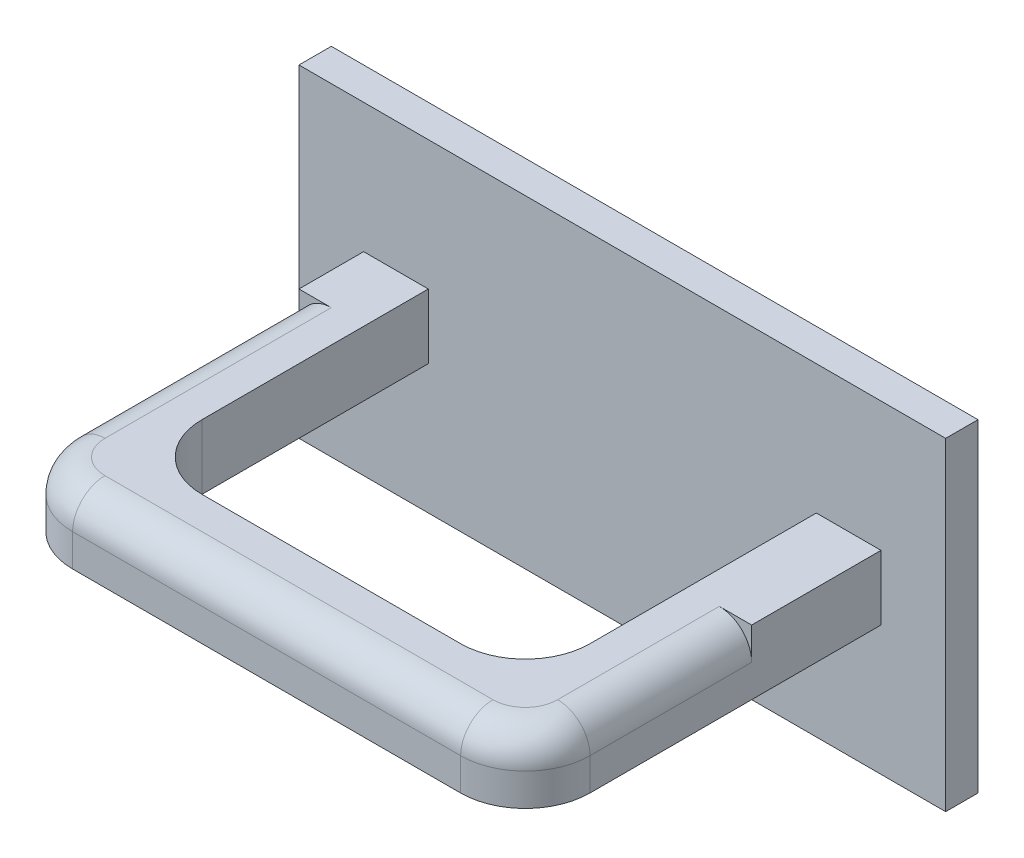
ISO-10303-21;
HEADER;
FILE_DESCRIPTION(('STEP AP214'),'2;1');
FILE_NAME('part.step','',(''),(''),'','','');
FILE_SCHEMA(('AUTOMOTIVE_DESIGN { 1 0 10303 214 1 1 1 1 }'));
ENDSEC;
DATA;
#1=APPLICATION_CONTEXT('core data for automotive mechanical design processes');
#2=APPLICATION_PROTOCOL_DEFINITION('international standard','automotive_design',2000,#1);
#3=PRODUCT_CONTEXT('',#1,'mechanical');
#4=PRODUCT('Part','Part','',(#3));
#5=PRODUCT_RELATED_PRODUCT_CATEGORY('part','',(#4));
#6=PRODUCT_DEFINITION_FORMATION('','',#4);
#7=PRODUCT_DEFINITION_CONTEXT('part definition',#1,'design');
#8=PRODUCT_DEFINITION('design','',#6,#7);
#9=PRODUCT_DEFINITION_SHAPE('','',#8);
#10=(LENGTH_UNIT() NAMED_UNIT(*) SI_UNIT(.MILLI.,.METRE.));
#11=(NAMED_UNIT(*) PLANE_ANGLE_UNIT() SI_UNIT($,.RADIAN.));
#12=(NAMED_UNIT(*) SI_UNIT($,.STERADIAN.) SOLID_ANGLE_UNIT());
#13=UNCERTAINTY_MEASURE_WITH_UNIT(LENGTH_MEASURE(1.E-05),#10,'distance_accuracy_value','');
#14=(GEOMETRIC_REPRESENTATION_CONTEXT(3) GLOBAL_UNCERTAINTY_ASSIGNED_CONTEXT((#13)) GLOBAL_UNIT_ASSIGNED_CONTEXT((#10,
#11,#12)) REPRESENTATION_CONTEXT('',''));
#15=CARTESIAN_POINT('',(0.,0.,0.));
#16=DIRECTION('',(0.,0.,1.));
#17=DIRECTION('',(1.,0.,0.));
#18=AXIS2_PLACEMENT_3D('',#15,#16,#17);
#19=CARTESIAN_POINT('',(-50.,25.,5.));
#20=DIRECTION('',(1.,0.,0.));
#21=DIRECTION('',(0.,1.,0.));
#22=AXIS2_PLACEMENT_3D('',#19,#20,#21);
#23=PLANE('',#22);
#24=DIRECTION('',(0.,-1.,0.));
#25=VECTOR('',#24,1.);
#26=CARTESIAN_POINT('',(-50.,25.,0.));
#27=LINE('',#26,#25);
#28=CARTESIAN_POINT('',(-50.,25.,0.));
#29=VERTEX_POINT('',#28);
#30=CARTESIAN_POINT('',(-50.,-25.,0.));
#31=VERTEX_POINT('',#30);
#32=EDGE_CURVE('E216',#29,#31,#27,.T.);
#33=ORIENTED_EDGE('',*,*,#32,.T.);
#34=DIRECTION('',(0.,0.,-1.));
#35=VECTOR('',#34,1.);
#36=CARTESIAN_POINT('',(-50.,-25.,5.));
#37=LINE('',#36,#35);
#38=CARTESIAN_POINT('',(-50.,-25.,5.));
#39=VERTEX_POINT('',#38);
#40=EDGE_CURVE('E264',#39,#31,#37,.T.);
#41=ORIENTED_EDGE('',*,*,#40,.F.);
#42=DIRECTION('',(0.,-1.,0.));
#43=VECTOR('',#42,1.);
#44=CARTESIAN_POINT('',(-50.,25.,5.));
#45=LINE('',#44,#43);
#46=CARTESIAN_POINT('',(-50.,25.,5.));
#47=VERTEX_POINT('',#46);
#48=EDGE_CURVE('E229',#47,#39,#45,.T.);
#49=ORIENTED_EDGE('',*,*,#48,.F.);
#50=DIRECTION('',(0.,0.,-1.));
#51=VECTOR('',#50,1.);
#52=CARTESIAN_POINT('',(-50.,25.,5.));
#53=LINE('',#52,#51);
#54=EDGE_CURVE('E244',#47,#29,#53,.T.);
#55=ORIENTED_EDGE('',*,*,#54,.T.);
#56=EDGE_LOOP('',(#33,#41,#49,#55));
#57=FACE_BOUND('',#56,.T.);
#58=ADVANCED_FACE('F42',(#57),#23,.F.);
#59=CARTESIAN_POINT('',(-50.,-25.,5.));
#60=DIRECTION('',(0.,1.,0.));
#61=DIRECTION('',(0.,0.,1.));
#62=AXIS2_PLACEMENT_3D('',#59,#60,#61);
#63=PLANE('',#62);
#64=DIRECTION('',(1.,0.,0.));
#65=VECTOR('',#64,1.);
#66=CARTESIAN_POINT('',(-50.,-25.,0.));
#67=LINE('',#66,#65);
#68=CARTESIAN_POINT('',(50.,-25.,0.));
#69=VERTEX_POINT('',#68);
#70=EDGE_CURVE('E222',#31,#69,#67,.T.);
#71=ORIENTED_EDGE('',*,*,#70,.T.);
#72=DIRECTION('',(0.,0.,-1.));
#73=VECTOR('',#72,1.);
#74=CARTESIAN_POINT('',(50.,-25.,5.));
#75=LINE('',#74,#73);
#76=CARTESIAN_POINT('',(50.,-25.,5.));
#77=VERTEX_POINT('',#76);
#78=EDGE_CURVE('E261',#77,#69,#75,.T.);
#79=ORIENTED_EDGE('',*,*,#78,.F.);
#80=DIRECTION('',(1.,0.,0.));
#81=VECTOR('',#80,1.);
#82=CARTESIAN_POINT('',(-50.,-25.,5.));
#83=LINE('',#82,#81);
#84=EDGE_CURVE('E233',#39,#77,#83,.T.);
#85=ORIENTED_EDGE('',*,*,#84,.F.);
#86=ORIENTED_EDGE('',*,*,#40,.T.);
#87=EDGE_LOOP('',(#71,#79,#85,#86));
#88=FACE_BOUND('',#87,.T.);
#89=ADVANCED_FACE('F474',(#88),#63,.F.);
#90=CARTESIAN_POINT('',(50.,25.,5.));
#91=DIRECTION('',(1.,0.,0.));
#92=DIRECTION('',(0.,1.,0.));
#93=AXIS2_PLACEMENT_3D('',#90,#91,#92);
#94=PLANE('',#93);
#95=DIRECTION('',(0.,-1.,0.));
#96=VECTOR('',#95,1.);
#97=CARTESIAN_POINT('',(50.,25.,0.));
#98=LINE('',#97,#96);
#99=CARTESIAN_POINT('',(50.,25.,0.));
#100=VERTEX_POINT('',#99);
#101=EDGE_CURVE('E249',#100,#69,#98,.T.);
#102=ORIENTED_EDGE('',*,*,#101,.F.);
#103=DIRECTION('',(0.,0.,-1.));
#104=VECTOR('',#103,1.);
#105=CARTESIAN_POINT('',(50.,25.,5.));
#106=LINE('',#105,#104);
#107=CARTESIAN_POINT('',(50.,25.,5.));
#108=VERTEX_POINT('',#107);
#109=EDGE_CURVE('E258',#108,#100,#106,.T.);
#110=ORIENTED_EDGE('',*,*,#109,.F.);
#111=DIRECTION('',(0.,-1.,0.));
#112=VECTOR('',#111,1.);
#113=CARTESIAN_POINT('',(50.,25.,5.));
#114=LINE('',#113,#112);
#115=EDGE_CURVE('E237',#108,#77,#114,.T.);
#116=ORIENTED_EDGE('',*,*,#115,.T.);
#117=ORIENTED_EDGE('',*,*,#78,.T.);
#118=EDGE_LOOP('',(#102,#110,#116,#117));
#119=FACE_BOUND('',#118,.T.);
#120=ADVANCED_FACE('F480',(#119),#94,.T.);
#121=CARTESIAN_POINT('',(-50.,25.,5.));
#122=DIRECTION('',(0.,1.,0.));
#123=DIRECTION('',(0.,0.,1.));
#124=AXIS2_PLACEMENT_3D('',#121,#122,#123);
#125=PLANE('',#124);
#126=DIRECTION('',(1.,0.,0.));
#127=VECTOR('',#126,1.);
#128=CARTESIAN_POINT('',(-50.,25.,0.));
#129=LINE('',#128,#127);
#130=EDGE_CURVE('E234',#29,#100,#129,.T.);
#131=ORIENTED_EDGE('',*,*,#130,.F.);
#132=ORIENTED_EDGE('',*,*,#54,.F.);
#133=DIRECTION('',(1.,0.,0.));
#134=VECTOR('',#133,1.);
#135=CARTESIAN_POINT('',(-50.,25.,5.));
#136=LINE('',#135,#134);
#137=EDGE_CURVE('E241',#47,#108,#136,.T.);
#138=ORIENTED_EDGE('',*,*,#137,.T.);
#139=ORIENTED_EDGE('',*,*,#109,.T.);
#140=EDGE_LOOP('',(#131,#132,#138,#139));
#141=FACE_BOUND('',#140,.T.);
#142=ADVANCED_FACE('F656',(#141),#125,.T.);
#143=CARTESIAN_POINT('',(0.,0.,5.));
#144=DIRECTION('',(0.,0.,1.));
#145=DIRECTION('',(1.,0.,0.));
#146=AXIS2_PLACEMENT_3D('',#143,#144,#145);
#147=PLANE('',#146);
#148=DIRECTION('',(-1.,0.,0.));
#149=VECTOR('',#148,1.);
#150=CARTESIAN_POINT('',(40.,5.,5.));
#151=LINE('',#150,#149);
#152=CARTESIAN_POINT('',(40.,5.,5.));
#153=VERTEX_POINT('',#152);
#154=CARTESIAN_POINT('',(30.,5.,5.));
#155=VERTEX_POINT('',#154);
#156=EDGE_CURVE('E438',#153,#155,#151,.T.);
#157=ORIENTED_EDGE('',*,*,#156,.F.);
#158=DIRECTION('',(0.,-1.,0.));
#159=VECTOR('',#158,1.);
#160=CARTESIAN_POINT('',(40.,5.,5.));
#161=LINE('',#160,#159);
#162=CARTESIAN_POINT('',(40.,-5.,5.));
#163=VERTEX_POINT('',#162);
#164=EDGE_CURVE('E217',#153,#163,#161,.T.);
#165=ORIENTED_EDGE('',*,*,#164,.T.);
#166=DIRECTION('',(-1.,0.,0.));
#167=VECTOR('',#166,1.);
#168=CARTESIAN_POINT('',(40.,-5.,5.));
#169=LINE('',#168,#167);
#170=CARTESIAN_POINT('',(30.,-5.,5.));
#171=VERTEX_POINT('',#170);
#172=EDGE_CURVE('E390',#163,#171,#169,.T.);
#173=ORIENTED_EDGE('',*,*,#172,.T.);
#174=DIRECTION('',(0.,-1.,0.));
#175=VECTOR('',#174,1.);
#176=CARTESIAN_POINT('',(30.,5.,5.));
#177=LINE('',#176,#175);
#178=EDGE_CURVE('E225',#155,#171,#177,.T.);
#179=ORIENTED_EDGE('',*,*,#178,.F.);
#180=EDGE_LOOP('',(#157,#165,#173,#179));
#181=FACE_BOUND('',#180,.T.);
#182=DIRECTION('',(-1.,0.,0.));
#183=VECTOR('',#182,1.);
#184=CARTESIAN_POINT('',(-30.,5.,5.));
#185=LINE('',#184,#183);
#186=CARTESIAN_POINT('',(-30.,5.,5.));
#187=VERTEX_POINT('',#186);
#188=CARTESIAN_POINT('',(-40.,5.,5.));
#189=VERTEX_POINT('',#188);
#190=EDGE_CURVE('E198',#187,#189,#185,.T.);
#191=ORIENTED_EDGE('',*,*,#190,.F.);
#192=DIRECTION('',(0.,-1.,0.));
#193=VECTOR('',#192,1.);
#194=CARTESIAN_POINT('',(-30.,5.,5.));
#195=LINE('',#194,#193);
#196=CARTESIAN_POINT('',(-30.,-5.,5.));
#197=VERTEX_POINT('',#196);
#198=EDGE_CURVE('E404',#187,#197,#195,.T.);
#199=ORIENTED_EDGE('',*,*,#198,.T.);
#200=DIRECTION('',(-1.,0.,0.));
#201=VECTOR('',#200,1.);
#202=CARTESIAN_POINT('',(-30.,-5.,5.));
#203=LINE('',#202,#201);
#204=CARTESIAN_POINT('',(-40.,-5.,5.));
#205=VERTEX_POINT('',#204);
#206=EDGE_CURVE('E214',#197,#205,#203,.T.);
#207=ORIENTED_EDGE('',*,*,#206,.T.);
#208=DIRECTION('',(0.,-1.,0.));
#209=VECTOR('',#208,1.);
#210=CARTESIAN_POINT('',(-40.,5.,5.));
#211=LINE('',#210,#209);
#212=EDGE_CURVE('E191',#189,#205,#211,.T.);
#213=ORIENTED_EDGE('',*,*,#212,.F.);
#214=EDGE_LOOP('',(#191,#199,#207,#213));
#215=FACE_BOUND('',#214,.T.);
#216=ORIENTED_EDGE('',*,*,#48,.T.);
#217=ORIENTED_EDGE('',*,*,#84,.T.);
#218=ORIENTED_EDGE('',*,*,#115,.F.);
#219=ORIENTED_EDGE('',*,*,#137,.F.);
#220=EDGE_LOOP('',(#216,#217,#218,#219));
#221=FACE_BOUND('',#220,.T.);
#222=ADVANCED_FACE('F211',(#181,#215,#221),#147,.T.);
#223=CARTESIAN_POINT('',(0.,0.,0.));
#224=DIRECTION('',(0.,0.,1.));
#225=DIRECTION('',(1.,0.,0.));
#226=AXIS2_PLACEMENT_3D('',#223,#224,#225);
#227=PLANE('',#226);
#228=ORIENTED_EDGE('',*,*,#32,.F.);
#229=ORIENTED_EDGE('',*,*,#130,.T.);
#230=ORIENTED_EDGE('',*,*,#101,.T.);
#231=ORIENTED_EDGE('',*,*,#70,.F.);
#232=EDGE_LOOP('',(#228,#229,#230,#231));
#233=FACE_BOUND('',#232,.T.);
#234=ADVANCED_FACE('F640',(#233),#227,.F.);
#235=CARTESIAN_POINT('',(-40.,5.,5.));
#236=DIRECTION('',(1.,0.,0.));
#237=DIRECTION('',(0.,0.,-1.));
#238=AXIS2_PLACEMENT_3D('',#235,#236,#237);
#239=PLANE('',#238);
#240=DIRECTION('',(0.,-1.,0.));
#241=VECTOR('',#240,1.);
#242=CARTESIAN_POINT('',(-40.,5.,50.));
#243=LINE('',#242,#241);
#244=CARTESIAN_POINT('',(-40.,-5.,50.));
#245=VERTEX_POINT('',#244);
#246=CARTESIAN_POINT('',(-40.,0.,50.));
#247=VERTEX_POINT('',#246);
#248=EDGE_CURVE('E292',#245,#247,#243,.F.);
#249=ORIENTED_EDGE('',*,*,#248,.T.);
#250=DIRECTION('',(0.,0.,1.));
#251=VECTOR('',#250,1.);
#252=CARTESIAN_POINT('',(-40.,0.,5.));
#253=LINE('',#252,#251);
#254=CARTESIAN_POINT('',(-40.,0.,15.));
#255=VERTEX_POINT('',#254);
#256=EDGE_CURVE('E11',#247,#255,#253,.F.);
#257=ORIENTED_EDGE('',*,*,#256,.T.);
#258=DIRECTION('',(0.,1.,0.));
#259=VECTOR('',#258,1.);
#260=CARTESIAN_POINT('',(-40.,0.,15.));
#261=LINE('',#260,#259);
#262=CARTESIAN_POINT('',(-40.,5.,15.));
#263=VERTEX_POINT('',#262);
#264=EDGE_CURVE('E52',#255,#263,#261,.T.);
#265=ORIENTED_EDGE('',*,*,#264,.T.);
#266=DIRECTION('',(0.,0.,1.));
#267=VECTOR('',#266,1.);
#268=CARTESIAN_POINT('',(-40.,5.,5.));
#269=LINE('',#268,#267);
#270=EDGE_CURVE('E186',#189,#263,#269,.T.);
#271=ORIENTED_EDGE('',*,*,#270,.F.);
#272=ORIENTED_EDGE('',*,*,#212,.T.);
#273=DIRECTION('',(0.,0.,1.));
#274=VECTOR('',#273,1.);
#275=CARTESIAN_POINT('',(-40.,-5.,5.));
#276=LINE('',#275,#274);
#277=EDGE_CURVE('E376',#205,#245,#276,.T.);
#278=ORIENTED_EDGE('',*,*,#277,.T.);
#279=EDGE_LOOP('',(#249,#257,#265,#271,#272,#278));
#280=FACE_BOUND('',#279,.T.);
#281=ADVANCED_FACE('F188',(#280),#239,.F.);
#282=CARTESIAN_POINT('',(-40.,5.,60.));
#283=DIRECTION('',(0.,0.,-1.));
#284=DIRECTION('',(-1.,0.,0.));
#285=AXIS2_PLACEMENT_3D('',#282,#283,#284);
#286=PLANE('',#285);
#287=DIRECTION('',(0.,-1.,0.));
#288=VECTOR('',#287,1.);
#289=CARTESIAN_POINT('',(30.,5.,60.));
#290=LINE('',#289,#288);
#291=CARTESIAN_POINT('',(30.,-5.,60.));
#292=VERTEX_POINT('',#291);
#293=CARTESIAN_POINT('',(30.,0.,60.));
#294=VERTEX_POINT('',#293);
#295=EDGE_CURVE('E279',#292,#294,#290,.F.);
#296=ORIENTED_EDGE('',*,*,#295,.T.);
#297=DIRECTION('',(1.,0.,0.));
#298=VECTOR('',#297,1.);
#299=CARTESIAN_POINT('',(-30.,0.,60.));
#300=LINE('',#299,#298);
#301=CARTESIAN_POINT('',(-30.,0.,60.));
#302=VERTEX_POINT('',#301);
#303=EDGE_CURVE('E343',#294,#302,#300,.F.);
#304=ORIENTED_EDGE('',*,*,#303,.T.);
#305=DIRECTION('',(0.,-1.,0.));
#306=VECTOR('',#305,1.);
#307=CARTESIAN_POINT('',(-30.,5.,60.));
#308=LINE('',#307,#306);
#309=CARTESIAN_POINT('',(-30.,-5.,60.));
#310=VERTEX_POINT('',#309);
#311=EDGE_CURVE('E283',#302,#310,#308,.T.);
#312=ORIENTED_EDGE('',*,*,#311,.T.);
#313=DIRECTION('',(1.,0.,0.));
#314=VECTOR('',#313,1.);
#315=CARTESIAN_POINT('',(-40.,-5.,60.));
#316=LINE('',#315,#314);
#317=EDGE_CURVE('E379',#310,#292,#316,.T.);
#318=ORIENTED_EDGE('',*,*,#317,.T.);
#319=EDGE_LOOP('',(#296,#304,#312,#318));
#320=FACE_BOUND('',#319,.T.);
#321=ADVANCED_FACE('F457',(#320),#286,.F.);
#322=CARTESIAN_POINT('',(40.,5.,60.));
#323=DIRECTION('',(-1.,0.,0.));
#324=DIRECTION('',(0.,0.,1.));
#325=AXIS2_PLACEMENT_3D('',#322,#323,#324);
#326=PLANE('',#325);
#327=DIRECTION('',(0.,0.,-1.));
#328=VECTOR('',#327,1.);
#329=CARTESIAN_POINT('',(40.,5.,60.));
#330=LINE('',#329,#328);
#331=CARTESIAN_POINT('',(40.,5.,25.));
#332=VERTEX_POINT('',#331);
#333=EDGE_CURVE('E197',#332,#153,#330,.T.);
#334=ORIENTED_EDGE('',*,*,#333,.F.);
#335=DIRECTION('',(0.,-1.,0.));
#336=VECTOR('',#335,1.);
#337=CARTESIAN_POINT('',(40.,0.,25.));
#338=LINE('',#337,#336);
#339=CARTESIAN_POINT('',(40.,0.,25.));
#340=VERTEX_POINT('',#339);
#341=EDGE_CURVE('E337',#332,#340,#338,.T.);
#342=ORIENTED_EDGE('',*,*,#341,.T.);
#343=DIRECTION('',(0.,0.,-1.));
#344=VECTOR('',#343,1.);
#345=CARTESIAN_POINT('',(40.,0.,50.));
#346=LINE('',#345,#344);
#347=CARTESIAN_POINT('',(40.,0.,50.));
#348=VERTEX_POINT('',#347);
#349=EDGE_CURVE('E334',#340,#348,#346,.F.);
#350=ORIENTED_EDGE('',*,*,#349,.T.);
#351=DIRECTION('',(0.,-1.,0.));
#352=VECTOR('',#351,1.);
#353=CARTESIAN_POINT('',(40.,5.,50.));
#354=LINE('',#353,#352);
#355=CARTESIAN_POINT('',(40.,-5.,50.));
#356=VERTEX_POINT('',#355);
#357=EDGE_CURVE('E295',#348,#356,#354,.T.);
#358=ORIENTED_EDGE('',*,*,#357,.T.);
#359=DIRECTION('',(0.,0.,-1.));
#360=VECTOR('',#359,1.);
#361=CARTESIAN_POINT('',(40.,-5.,60.));
#362=LINE('',#361,#360);
#363=EDGE_CURVE('E387',#356,#163,#362,.T.);
#364=ORIENTED_EDGE('',*,*,#363,.T.);
#365=ORIENTED_EDGE('',*,*,#164,.F.);
#366=EDGE_LOOP('',(#334,#342,#350,#358,#364,#365));
#367=FACE_BOUND('',#366,.T.);
#368=ADVANCED_FACE('F448',(#367),#326,.F.);
#369=CARTESIAN_POINT('',(30.,5.,5.));
#370=DIRECTION('',(1.,0.,0.));
#371=DIRECTION('',(0.,0.,-1.));
#372=AXIS2_PLACEMENT_3D('',#369,#370,#371);
#373=PLANE('',#372);
#374=DIRECTION('',(0.,0.,1.));
#375=VECTOR('',#374,1.);
#376=CARTESIAN_POINT('',(30.,-5.,5.));
#377=LINE('',#376,#375);
#378=CARTESIAN_POINT('',(30.,-5.,40.));
#379=VERTEX_POINT('',#378);
#380=EDGE_CURVE('E394',#171,#379,#377,.T.);
#381=ORIENTED_EDGE('',*,*,#380,.T.);
#382=DIRECTION('',(0.,-1.,0.));
#383=VECTOR('',#382,1.);
#384=CARTESIAN_POINT('',(30.,5.,40.));
#385=LINE('',#384,#383);
#386=CARTESIAN_POINT('',(30.,5.,40.));
#387=VERTEX_POINT('',#386);
#388=EDGE_CURVE('E298',#379,#387,#385,.F.);
#389=ORIENTED_EDGE('',*,*,#388,.T.);
#390=DIRECTION('',(0.,0.,1.));
#391=VECTOR('',#390,1.);
#392=CARTESIAN_POINT('',(30.,5.,5.));
#393=LINE('',#392,#391);
#394=EDGE_CURVE('E414',#155,#387,#393,.T.);
#395=ORIENTED_EDGE('',*,*,#394,.F.);
#396=ORIENTED_EDGE('',*,*,#178,.T.);
#397=EDGE_LOOP('',(#381,#389,#395,#396));
#398=FACE_BOUND('',#397,.T.);
#399=ADVANCED_FACE('F411',(#398),#373,.F.);
#400=CARTESIAN_POINT('',(30.,5.,50.));
#401=DIRECTION('',(0.,0.,1.));
#402=DIRECTION('',(1.,0.,0.));
#403=AXIS2_PLACEMENT_3D('',#400,#401,#402);
#404=PLANE('',#403);
#405=DIRECTION('',(-1.,0.,0.));
#406=VECTOR('',#405,1.);
#407=CARTESIAN_POINT('',(30.,-5.,50.));
#408=LINE('',#407,#406);
#409=CARTESIAN_POINT('',(20.,-5.,50.));
#410=VERTEX_POINT('',#409);
#411=CARTESIAN_POINT('',(-20.,-5.,50.));
#412=VERTEX_POINT('',#411);
#413=EDGE_CURVE('E398',#410,#412,#408,.T.);
#414=ORIENTED_EDGE('',*,*,#413,.T.);
#415=DIRECTION('',(0.,-1.,0.));
#416=VECTOR('',#415,1.);
#417=CARTESIAN_POINT('',(-20.,5.,50.));
#418=LINE('',#417,#416);
#419=CARTESIAN_POINT('',(-20.,5.,50.));
#420=VERTEX_POINT('',#419);
#421=EDGE_CURVE('E276',#412,#420,#418,.F.);
#422=ORIENTED_EDGE('',*,*,#421,.T.);
#423=DIRECTION('',(-1.,0.,0.));
#424=VECTOR('',#423,1.);
#425=CARTESIAN_POINT('',(30.,5.,50.));
#426=LINE('',#425,#424);
#427=CARTESIAN_POINT('',(20.,5.,50.));
#428=VERTEX_POINT('',#427);
#429=EDGE_CURVE('E433',#428,#420,#426,.T.);
#430=ORIENTED_EDGE('',*,*,#429,.F.);
#431=DIRECTION('',(0.,-1.,0.));
#432=VECTOR('',#431,1.);
#433=CARTESIAN_POINT('',(20.,-5.,50.));
#434=LINE('',#433,#432);
#435=EDGE_CURVE('E272',#428,#410,#434,.T.);
#436=ORIENTED_EDGE('',*,*,#435,.T.);
#437=EDGE_LOOP('',(#414,#422,#430,#436));
#438=FACE_BOUND('',#437,.T.);
#439=ADVANCED_FACE('F430',(#438),#404,.F.);
#440=CARTESIAN_POINT('',(-30.,5.,50.));
#441=DIRECTION('',(-1.,0.,0.));
#442=DIRECTION('',(0.,0.,1.));
#443=AXIS2_PLACEMENT_3D('',#440,#441,#442);
#444=PLANE('',#443);
#445=DIRECTION('',(0.,0.,-1.));
#446=VECTOR('',#445,1.);
#447=CARTESIAN_POINT('',(-30.,5.,50.));
#448=LINE('',#447,#446);
#449=CARTESIAN_POINT('',(-30.,5.,40.));
#450=VERTEX_POINT('',#449);
#451=EDGE_CURVE('E203',#450,#187,#448,.T.);
#452=ORIENTED_EDGE('',*,*,#451,.F.);
#453=DIRECTION('',(0.,-1.,0.));
#454=VECTOR('',#453,1.);
#455=CARTESIAN_POINT('',(-30.,-5.,40.));
#456=LINE('',#455,#454);
#457=CARTESIAN_POINT('',(-30.,-5.,40.));
#458=VERTEX_POINT('',#457);
#459=EDGE_CURVE('E268',#450,#458,#456,.T.);
#460=ORIENTED_EDGE('',*,*,#459,.T.);
#461=DIRECTION('',(0.,0.,-1.));
#462=VECTOR('',#461,1.);
#463=CARTESIAN_POINT('',(-30.,-5.,50.));
#464=LINE('',#463,#462);
#465=EDGE_CURVE('E208',#458,#197,#464,.T.);
#466=ORIENTED_EDGE('',*,*,#465,.T.);
#467=ORIENTED_EDGE('',*,*,#198,.F.);
#468=EDGE_LOOP('',(#452,#460,#466,#467));
#469=FACE_BOUND('',#468,.T.);
#470=ADVANCED_FACE('F597',(#469),#444,.F.);
#471=CARTESIAN_POINT('',(0.,5.,0.));
#472=DIRECTION('',(0.,1.,0.));
#473=DIRECTION('',(0.,0.,1.));
#474=AXIS2_PLACEMENT_3D('',#471,#472,#473);
#475=PLANE('',#474);
#476=DIRECTION('',(0.,0.,-1.));
#477=VECTOR('',#476,1.);
#478=CARTESIAN_POINT('',(35.,5.,5.));
#479=LINE('',#478,#477);
#480=CARTESIAN_POINT('',(35.,5.,50.));
#481=VERTEX_POINT('',#480);
#482=CARTESIAN_POINT('',(35.,5.,25.));
#483=VERTEX_POINT('',#482);
#484=EDGE_CURVE('E328',#481,#483,#479,.T.);
#485=ORIENTED_EDGE('',*,*,#484,.T.);
#486=DIRECTION('',(1.,0.,0.));
#487=VECTOR('',#486,1.);
#488=CARTESIAN_POINT('',(0.,5.,25.));
#489=LINE('',#488,#487);
#490=EDGE_CURVE('E331',#483,#332,#489,.T.);
#491=ORIENTED_EDGE('',*,*,#490,.T.);
#492=ORIENTED_EDGE('',*,*,#333,.T.);
#493=ORIENTED_EDGE('',*,*,#156,.T.);
#494=ORIENTED_EDGE('',*,*,#394,.T.);
#495=CARTESIAN_POINT('',(20.,5.,40.));
#496=DIRECTION('',(0.,1.,0.));
#497=DIRECTION('',(0.,0.,1.));
#498=AXIS2_PLACEMENT_3D('',#495,#496,#497);
#499=CIRCLE('',#498,10.);
#500=EDGE_CURVE('E310',#387,#428,#499,.F.);
#501=ORIENTED_EDGE('',*,*,#500,.T.);
#502=ORIENTED_EDGE('',*,*,#429,.T.);
#503=CARTESIAN_POINT('',(-20.,5.,40.));
#504=DIRECTION('',(0.,1.,0.));
#505=DIRECTION('',(0.,0.,1.));
#506=AXIS2_PLACEMENT_3D('',#503,#504,#505);
#507=CIRCLE('',#506,10.);
#508=EDGE_CURVE('E304',#420,#450,#507,.F.);
#509=ORIENTED_EDGE('',*,*,#508,.T.);
#510=ORIENTED_EDGE('',*,*,#451,.T.);
#511=ORIENTED_EDGE('',*,*,#190,.T.);
#512=ORIENTED_EDGE('',*,*,#270,.T.);
#513=DIRECTION('',(1.,0.,0.));
#514=VECTOR('',#513,1.);
#515=CARTESIAN_POINT('',(0.,5.,15.));
#516=LINE('',#515,#514);
#517=CARTESIAN_POINT('',(-35.,5.,15.));
#518=VERTEX_POINT('',#517);
#519=EDGE_CURVE('E316',#263,#518,#516,.T.);
#520=ORIENTED_EDGE('',*,*,#519,.T.);
#521=DIRECTION('',(0.,0.,1.));
#522=VECTOR('',#521,1.);
#523=CARTESIAN_POINT('',(-35.,5.,50.));
#524=LINE('',#523,#522);
#525=CARTESIAN_POINT('',(-35.,5.,50.));
#526=VERTEX_POINT('',#525);
#527=EDGE_CURVE('E313',#518,#526,#524,.T.);
#528=ORIENTED_EDGE('',*,*,#527,.T.);
#529=CARTESIAN_POINT('',(-30.,5.,50.));
#530=DIRECTION('',(0.,1.,0.));
#531=DIRECTION('',(0.,0.,1.));
#532=AXIS2_PLACEMENT_3D('',#529,#530,#531);
#533=CIRCLE('',#532,5.);
#534=CARTESIAN_POINT('',(-30.,5.,55.));
#535=VERTEX_POINT('',#534);
#536=EDGE_CURVE('E319',#526,#535,#533,.T.);
#537=ORIENTED_EDGE('',*,*,#536,.T.);
#538=DIRECTION('',(1.,0.,0.));
#539=VECTOR('',#538,1.);
#540=CARTESIAN_POINT('',(30.,5.,55.));
#541=LINE('',#540,#539);
#542=CARTESIAN_POINT('',(30.,5.,55.));
#543=VERTEX_POINT('',#542);
#544=EDGE_CURVE('E322',#535,#543,#541,.T.);
#545=ORIENTED_EDGE('',*,*,#544,.T.);
#546=CARTESIAN_POINT('',(30.,5.,50.));
#547=DIRECTION('',(0.,1.,0.));
#548=DIRECTION('',(0.,0.,1.));
#549=AXIS2_PLACEMENT_3D('',#546,#547,#548);
#550=CIRCLE('',#549,5.);
#551=EDGE_CURVE('E325',#543,#481,#550,.T.);
#552=ORIENTED_EDGE('',*,*,#551,.T.);
#553=EDGE_LOOP('',(#485,#491,#492,#493,#494,#501,#502,#509,#510,#511,#512,#520,#528,#537,#545,#552));
#554=FACE_BOUND('',#553,.T.);
#555=ADVANCED_FACE('F201',(#554),#475,.T.);
#556=CARTESIAN_POINT('',(0.,-5.,0.));
#557=DIRECTION('',(0.,1.,0.));
#558=DIRECTION('',(0.,0.,1.));
#559=AXIS2_PLACEMENT_3D('',#556,#557,#558);
#560=PLANE('',#559);
#561=ORIENTED_EDGE('',*,*,#317,.F.);
#562=CARTESIAN_POINT('',(-30.,-5.,50.));
#563=DIRECTION('',(0.,1.,0.));
#564=DIRECTION('',(0.,0.,1.));
#565=AXIS2_PLACEMENT_3D('',#562,#563,#564);
#566=CIRCLE('',#565,10.);
#567=EDGE_CURVE('E289',#310,#245,#566,.F.);
#568=ORIENTED_EDGE('',*,*,#567,.T.);
#569=ORIENTED_EDGE('',*,*,#277,.F.);
#570=ORIENTED_EDGE('',*,*,#206,.F.);
#571=ORIENTED_EDGE('',*,*,#465,.F.);
#572=CARTESIAN_POINT('',(-20.,-5.,40.));
#573=DIRECTION('',(0.,1.,0.));
#574=DIRECTION('',(0.,0.,1.));
#575=AXIS2_PLACEMENT_3D('',#572,#573,#574);
#576=CIRCLE('',#575,10.);
#577=EDGE_CURVE('E301',#458,#412,#576,.T.);
#578=ORIENTED_EDGE('',*,*,#577,.T.);
#579=ORIENTED_EDGE('',*,*,#413,.F.);
#580=CARTESIAN_POINT('',(20.,-5.,40.));
#581=DIRECTION('',(0.,1.,0.));
#582=DIRECTION('',(0.,0.,1.));
#583=AXIS2_PLACEMENT_3D('',#580,#581,#582);
#584=CIRCLE('',#583,10.);
#585=EDGE_CURVE('E307',#410,#379,#584,.T.);
#586=ORIENTED_EDGE('',*,*,#585,.T.);
#587=ORIENTED_EDGE('',*,*,#380,.F.);
#588=ORIENTED_EDGE('',*,*,#172,.F.);
#589=ORIENTED_EDGE('',*,*,#363,.F.);
#590=CARTESIAN_POINT('',(30.,-5.,50.));
#591=DIRECTION('',(0.,1.,0.));
#592=DIRECTION('',(0.,0.,1.));
#593=AXIS2_PLACEMENT_3D('',#590,#591,#592);
#594=CIRCLE('',#593,10.);
#595=EDGE_CURVE('E286',#356,#292,#594,.F.);
#596=ORIENTED_EDGE('',*,*,#595,.T.);
#597=EDGE_LOOP('',(#561,#568,#569,#570,#571,#578,#579,#586,#587,#588,#589,#596));
#598=FACE_BOUND('',#597,.T.);
#599=ADVANCED_FACE('F422',(#598),#560,.F.);
#600=CARTESIAN_POINT('',(-20.,5.,40.));
#601=DIRECTION('',(0.,1.,0.));
#602=DIRECTION('',(0.,0.,1.));
#603=AXIS2_PLACEMENT_3D('',#600,#601,#602);
#604=CYLINDRICAL_SURFACE('',#603,10.);
#605=ORIENTED_EDGE('',*,*,#508,.F.);
#606=ORIENTED_EDGE('',*,*,#421,.F.);
#607=ORIENTED_EDGE('',*,*,#577,.F.);
#608=ORIENTED_EDGE('',*,*,#459,.F.);
#609=EDGE_LOOP('',(#605,#606,#607,#608));
#610=FACE_BOUND('',#609,.T.);
#611=ADVANCED_FACE('F485',(#610),#604,.F.);
#612=CARTESIAN_POINT('',(-30.,5.,50.));
#613=DIRECTION('',(0.,-1.,0.));
#614=DIRECTION('',(0.,0.,-1.));
#615=AXIS2_PLACEMENT_3D('',#612,#613,#614);
#616=CYLINDRICAL_SURFACE('',#615,10.);
#617=ORIENTED_EDGE('',*,*,#311,.F.);
#618=CARTESIAN_POINT('',(-30.,0.,50.));
#619=DIRECTION('',(0.,1.,0.));
#620=DIRECTION('',(0.,0.,1.));
#621=AXIS2_PLACEMENT_3D('',#618,#619,#620);
#622=CIRCLE('',#621,10.);
#623=EDGE_CURVE('E66',#302,#247,#622,.F.);
#624=ORIENTED_EDGE('',*,*,#623,.T.);
#625=ORIENTED_EDGE('',*,*,#248,.F.);
#626=ORIENTED_EDGE('',*,*,#567,.F.);
#627=EDGE_LOOP('',(#617,#624,#625,#626));
#628=FACE_BOUND('',#627,.T.);
#629=ADVANCED_FACE('F460',(#628),#616,.T.);
#630=CARTESIAN_POINT('',(30.,5.,50.));
#631=DIRECTION('',(0.,-1.,0.));
#632=DIRECTION('',(0.,0.,-1.));
#633=AXIS2_PLACEMENT_3D('',#630,#631,#632);
#634=CYLINDRICAL_SURFACE('',#633,10.);
#635=ORIENTED_EDGE('',*,*,#357,.F.);
#636=CARTESIAN_POINT('',(30.,0.,50.));
#637=DIRECTION('',(0.,1.,0.));
#638=DIRECTION('',(0.,0.,1.));
#639=AXIS2_PLACEMENT_3D('',#636,#637,#638);
#640=CIRCLE('',#639,10.);
#641=EDGE_CURVE('E340',#348,#294,#640,.F.);
#642=ORIENTED_EDGE('',*,*,#641,.T.);
#643=ORIENTED_EDGE('',*,*,#295,.F.);
#644=ORIENTED_EDGE('',*,*,#595,.F.);
#645=EDGE_LOOP('',(#635,#642,#643,#644));
#646=FACE_BOUND('',#645,.T.);
#647=ADVANCED_FACE('F455',(#646),#634,.T.);
#648=CARTESIAN_POINT('',(20.,5.,40.));
#649=DIRECTION('',(0.,1.,0.));
#650=DIRECTION('',(0.,0.,1.));
#651=AXIS2_PLACEMENT_3D('',#648,#649,#650);
#652=CYLINDRICAL_SURFACE('',#651,10.);
#653=ORIENTED_EDGE('',*,*,#500,.F.);
#654=ORIENTED_EDGE('',*,*,#388,.F.);
#655=ORIENTED_EDGE('',*,*,#585,.F.);
#656=ORIENTED_EDGE('',*,*,#435,.F.);
#657=EDGE_LOOP('',(#653,#654,#655,#656));
#658=FACE_BOUND('',#657,.T.);
#659=ADVANCED_FACE('F427',(#658),#652,.F.);
#660=CARTESIAN_POINT('',(-35.,0.,15.));
#661=DIRECTION('',(0.,0.,1.));
#662=DIRECTION('',(1.,0.,0.));
#663=AXIS2_PLACEMENT_3D('',#660,#661,#662);
#664=PLANE('',#663);
#665=ORIENTED_EDGE('',*,*,#519,.F.);
#666=ORIENTED_EDGE('',*,*,#264,.F.);
#667=CARTESIAN_POINT('',(-35.,0.,15.));
#668=DIRECTION('',(0.,0.,-1.));
#669=DIRECTION('',(-1.,0.,0.));
#670=AXIS2_PLACEMENT_3D('',#667,#668,#669);
#671=CIRCLE('',#670,5.);
#672=EDGE_CURVE('E46',#518,#255,#671,.F.);
#673=ORIENTED_EDGE('',*,*,#672,.F.);
#674=EDGE_LOOP('',(#665,#666,#673));
#675=FACE_BOUND('',#674,.T.);
#676=ADVANCED_FACE('F44',(#675),#664,.T.);
#677=CARTESIAN_POINT('',(-35.,0.,0.));
#678=DIRECTION('',(0.,0.,-1.));
#679=DIRECTION('',(-1.,0.,0.));
#680=AXIS2_PLACEMENT_3D('',#677,#678,#679);
#681=CYLINDRICAL_SURFACE('',#680,5.);
#682=ORIENTED_EDGE('',*,*,#672,.T.);
#683=ORIENTED_EDGE('',*,*,#256,.F.);
#684=CARTESIAN_POINT('',(-35.,0.,50.));
#685=DIRECTION('',(0.,0.,1.));
#686=DIRECTION('',(1.,0.,0.));
#687=AXIS2_PLACEMENT_3D('',#684,#685,#686);
#688=CIRCLE('',#687,5.);
#689=EDGE_CURVE('E365',#526,#247,#688,.T.);
#690=ORIENTED_EDGE('',*,*,#689,.F.);
#691=ORIENTED_EDGE('',*,*,#527,.F.);
#692=EDGE_LOOP('',(#682,#683,#690,#691));
#693=FACE_BOUND('',#692,.T.);
#694=ADVANCED_FACE('F461',(#693),#681,.T.);
#695=CARTESIAN_POINT('',(-30.,0.,50.));
#696=DIRECTION('',(0.,1.,0.));
#697=DIRECTION('',(0.,0.,1.));
#698=AXIS2_PLACEMENT_3D('',#695,#696,#697);
#699=DEGENERATE_TOROIDAL_SURFACE('',#698,5.,5.,.T.);
#700=ORIENTED_EDGE('',*,*,#689,.T.);
#701=ORIENTED_EDGE('',*,*,#623,.F.);
#702=CARTESIAN_POINT('',(-30.,0.,55.));
#703=DIRECTION('',(1.,0.,0.));
#704=DIRECTION('',(0.,0.,-1.));
#705=AXIS2_PLACEMENT_3D('',#702,#703,#704);
#706=CIRCLE('',#705,5.);
#707=EDGE_CURVE('E362',#535,#302,#706,.T.);
#708=ORIENTED_EDGE('',*,*,#707,.F.);
#709=ORIENTED_EDGE('',*,*,#536,.F.);
#710=EDGE_LOOP('',(#700,#701,#708,#709));
#711=FACE_BOUND('',#710,.T.);
#712=ADVANCED_FACE('F463',(#711),#699,.T.);
#713=CARTESIAN_POINT('',(0.,0.,55.));
#714=DIRECTION('',(-1.,0.,0.));
#715=DIRECTION('',(0.,0.,1.));
#716=AXIS2_PLACEMENT_3D('',#713,#714,#715);
#717=CYLINDRICAL_SURFACE('',#716,5.);
#718=ORIENTED_EDGE('',*,*,#707,.T.);
#719=ORIENTED_EDGE('',*,*,#303,.F.);
#720=CARTESIAN_POINT('',(30.,0.,55.));
#721=DIRECTION('',(1.,0.,0.));
#722=DIRECTION('',(0.,0.,-1.));
#723=AXIS2_PLACEMENT_3D('',#720,#721,#722);
#724=CIRCLE('',#723,5.);
#725=EDGE_CURVE('E358',#543,#294,#724,.T.);
#726=ORIENTED_EDGE('',*,*,#725,.F.);
#727=ORIENTED_EDGE('',*,*,#544,.F.);
#728=EDGE_LOOP('',(#718,#719,#726,#727));
#729=FACE_BOUND('',#728,.T.);
#730=ADVANCED_FACE('F504',(#729),#717,.T.);
#731=CARTESIAN_POINT('',(30.,0.,50.));
#732=DIRECTION('',(0.,1.,0.));
#733=DIRECTION('',(0.,0.,1.));
#734=AXIS2_PLACEMENT_3D('',#731,#732,#733);
#735=DEGENERATE_TOROIDAL_SURFACE('',#734,5.,5.,.T.);
#736=ORIENTED_EDGE('',*,*,#725,.T.);
#737=ORIENTED_EDGE('',*,*,#641,.F.);
#738=CARTESIAN_POINT('',(35.,0.,50.));
#739=DIRECTION('',(0.,0.,-1.));
#740=DIRECTION('',(-1.,0.,0.));
#741=AXIS2_PLACEMENT_3D('',#738,#739,#740);
#742=CIRCLE('',#741,5.);
#743=EDGE_CURVE('E354',#481,#348,#742,.T.);
#744=ORIENTED_EDGE('',*,*,#743,.F.);
#745=ORIENTED_EDGE('',*,*,#551,.F.);
#746=EDGE_LOOP('',(#736,#737,#744,#745));
#747=FACE_BOUND('',#746,.T.);
#748=ADVANCED_FACE('F500',(#747),#735,.T.);
#749=CARTESIAN_POINT('',(35.,0.,25.));
#750=DIRECTION('',(0.,0.,1.));
#751=DIRECTION('',(1.,0.,0.));
#752=AXIS2_PLACEMENT_3D('',#749,#750,#751);
#753=PLANE('',#752);
#754=ORIENTED_EDGE('',*,*,#341,.F.);
#755=ORIENTED_EDGE('',*,*,#490,.F.);
#756=CARTESIAN_POINT('',(35.,0.,25.));
#757=DIRECTION('',(0.,0.,-1.));
#758=DIRECTION('',(-1.,0.,0.));
#759=AXIS2_PLACEMENT_3D('',#756,#757,#758);
#760=CIRCLE('',#759,5.);
#761=EDGE_CURVE('E350',#340,#483,#760,.F.);
#762=ORIENTED_EDGE('',*,*,#761,.F.);
#763=EDGE_LOOP('',(#754,#755,#762));
#764=FACE_BOUND('',#763,.T.);
#765=ADVANCED_FACE('F496',(#764),#753,.T.);
#766=CARTESIAN_POINT('',(35.,0.,0.));
#767=DIRECTION('',(0.,0.,1.));
#768=DIRECTION('',(1.,0.,0.));
#769=AXIS2_PLACEMENT_3D('',#766,#767,#768);
#770=CYLINDRICAL_SURFACE('',#769,5.);
#771=ORIENTED_EDGE('',*,*,#743,.T.);
#772=ORIENTED_EDGE('',*,*,#349,.F.);
#773=ORIENTED_EDGE('',*,*,#761,.T.);
#774=ORIENTED_EDGE('',*,*,#484,.F.);
#775=EDGE_LOOP('',(#771,#772,#773,#774));
#776=FACE_BOUND('',#775,.T.);
#777=ADVANCED_FACE('F493',(#776),#770,.T.);
#778=CLOSED_SHELL('',(#58,#89,#120,#142,#222,#234,#281,#321,#368,#399,#439,#470,#555,#599,#611,
#629,#647,#659,#676,#694,#712,#730,#748,#765,#777));
#779=MANIFOLD_SOLID_BREP('B2',#778);
#780=ADVANCED_BREP_SHAPE_REPRESENTATION('',(#18,#779),#14);
#781=SHAPE_DEFINITION_REPRESENTATION(#9,#780);
ENDSEC;
END-ISO-10303-21;
